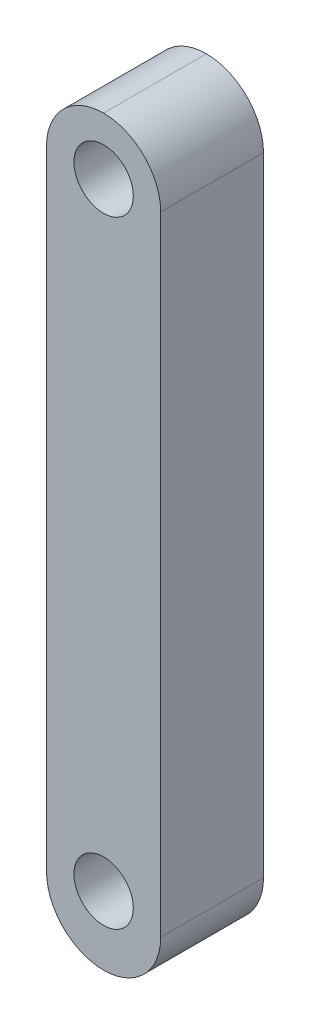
ISO-10303-21;
HEADER;
FILE_DESCRIPTION(('STEP AP214'),'2;1');
FILE_NAME('part.step','',(''),(''),'','','');
FILE_SCHEMA(('AUTOMOTIVE_DESIGN { 1 0 10303 214 1 1 1 1 }'));
ENDSEC;
DATA;
#1=APPLICATION_CONTEXT('core data for automotive mechanical design processes');
#2=APPLICATION_PROTOCOL_DEFINITION('international standard','automotive_design',2000,#1);
#3=PRODUCT_CONTEXT('',#1,'mechanical');
#4=PRODUCT('Part','Part','',(#3));
#5=PRODUCT_RELATED_PRODUCT_CATEGORY('part','',(#4));
#6=PRODUCT_DEFINITION_FORMATION('','',#4);
#7=PRODUCT_DEFINITION_CONTEXT('part definition',#1,'design');
#8=PRODUCT_DEFINITION('design','',#6,#7);
#9=PRODUCT_DEFINITION_SHAPE('','',#8);
#10=(LENGTH_UNIT() NAMED_UNIT(*) SI_UNIT(.MILLI.,.METRE.));
#11=(NAMED_UNIT(*) PLANE_ANGLE_UNIT() SI_UNIT($,.RADIAN.));
#12=(NAMED_UNIT(*) SI_UNIT($,.STERADIAN.) SOLID_ANGLE_UNIT());
#13=UNCERTAINTY_MEASURE_WITH_UNIT(LENGTH_MEASURE(1.E-05),#10,'distance_accuracy_value','');
#14=(GEOMETRIC_REPRESENTATION_CONTEXT(3) GLOBAL_UNCERTAINTY_ASSIGNED_CONTEXT((#13)) GLOBAL_UNIT_ASSIGNED_CONTEXT((#10,
#11,#12)) REPRESENTATION_CONTEXT('',''));
#15=CARTESIAN_POINT('',(0.,0.,0.));
#16=DIRECTION('',(0.,0.,1.));
#17=DIRECTION('',(1.,0.,0.));
#18=AXIS2_PLACEMENT_3D('',#15,#16,#17);
#19=CARTESIAN_POINT('',(2.5,16.25,4.5));
#20=DIRECTION('',(-1.,0.,0.));
#21=DIRECTION('',(0.,-1.,0.));
#22=AXIS2_PLACEMENT_3D('',#19,#20,#21);
#23=PLANE('',#22);
#24=DIRECTION('',(0.,1.,0.));
#25=VECTOR('',#24,1.);
#26=CARTESIAN_POINT('',(2.5,16.25,4.5));
#27=LINE('',#26,#25);
#28=CARTESIAN_POINT('',(2.5,-13.75,4.5));
#29=VERTEX_POINT('',#28);
#30=CARTESIAN_POINT('',(2.5,13.75,4.5));
#31=VERTEX_POINT('',#30);
#32=EDGE_CURVE('E161',#29,#31,#27,.T.);
#33=ORIENTED_EDGE('',*,*,#32,.F.);
#34=DIRECTION('',(0.,0.,-1.));
#35=VECTOR('',#34,1.);
#36=CARTESIAN_POINT('',(2.5,-13.75,4.5));
#37=LINE('',#36,#35);
#38=CARTESIAN_POINT('',(2.5,-13.75,0.));
#39=VERTEX_POINT('',#38);
#40=EDGE_CURVE('E11',#29,#39,#37,.T.);
#41=ORIENTED_EDGE('',*,*,#40,.T.);
#42=DIRECTION('',(0.,1.,0.));
#43=VECTOR('',#42,1.);
#44=CARTESIAN_POINT('',(2.5,16.25,0.));
#45=LINE('',#44,#43);
#46=CARTESIAN_POINT('',(2.5,13.75,0.));
#47=VERTEX_POINT('',#46);
#48=EDGE_CURVE('E101',#39,#47,#45,.T.);
#49=ORIENTED_EDGE('',*,*,#48,.T.);
#50=DIRECTION('',(0.,0.,-1.));
#51=VECTOR('',#50,1.);
#52=CARTESIAN_POINT('',(2.5,13.75,4.5));
#53=LINE('',#52,#51);
#54=EDGE_CURVE('E104',#47,#31,#53,.F.);
#55=ORIENTED_EDGE('',*,*,#54,.T.);
#56=EDGE_LOOP('',(#33,#41,#49,#55));
#57=FACE_BOUND('',#56,.T.);
#58=ADVANCED_FACE('F50',(#57),#23,.F.);
#59=CARTESIAN_POINT('',(-2.5,16.25,4.5));
#60=DIRECTION('',(1.,0.,0.));
#61=DIRECTION('',(0.,1.,0.));
#62=AXIS2_PLACEMENT_3D('',#59,#60,#61);
#63=PLANE('',#62);
#64=DIRECTION('',(0.,-1.,0.));
#65=VECTOR('',#64,1.);
#66=CARTESIAN_POINT('',(-2.5,16.25,0.));
#67=LINE('',#66,#65);
#68=CARTESIAN_POINT('',(-2.5,13.75,0.));
#69=VERTEX_POINT('',#68);
#70=CARTESIAN_POINT('',(-2.5,-13.75,0.));
#71=VERTEX_POINT('',#70);
#72=EDGE_CURVE('E109',#69,#71,#67,.T.);
#73=ORIENTED_EDGE('',*,*,#72,.T.);
#74=DIRECTION('',(0.,0.,-1.));
#75=VECTOR('',#74,1.);
#76=CARTESIAN_POINT('',(-2.5,-13.75,4.5));
#77=LINE('',#76,#75);
#78=CARTESIAN_POINT('',(-2.5,-13.75,4.5));
#79=VERTEX_POINT('',#78);
#80=EDGE_CURVE('E145',#71,#79,#77,.F.);
#81=ORIENTED_EDGE('',*,*,#80,.T.);
#82=DIRECTION('',(0.,-1.,0.));
#83=VECTOR('',#82,1.);
#84=CARTESIAN_POINT('',(-2.5,16.25,4.5));
#85=LINE('',#84,#83);
#86=CARTESIAN_POINT('',(-2.5,13.75,4.5));
#87=VERTEX_POINT('',#86);
#88=EDGE_CURVE('E154',#87,#79,#85,.T.);
#89=ORIENTED_EDGE('',*,*,#88,.F.);
#90=DIRECTION('',(0.,0.,-1.));
#91=VECTOR('',#90,1.);
#92=CARTESIAN_POINT('',(-2.5,13.75,4.5));
#93=LINE('',#92,#91);
#94=EDGE_CURVE('E132',#87,#69,#93,.T.);
#95=ORIENTED_EDGE('',*,*,#94,.T.);
#96=EDGE_LOOP('',(#73,#81,#89,#95));
#97=FACE_BOUND('',#96,.T.);
#98=ADVANCED_FACE('F153',(#97),#63,.F.);
#99=CARTESIAN_POINT('',(0.,0.,4.5));
#100=DIRECTION('',(0.,0.,1.));
#101=DIRECTION('',(1.,0.,0.));
#102=AXIS2_PLACEMENT_3D('',#99,#100,#101);
#103=PLANE('',#102);
#104=CARTESIAN_POINT('',(0.,-13.25,4.5));
#105=DIRECTION('',(0.,0.,1.));
#106=DIRECTION('',(1.,0.,0.));
#107=AXIS2_PLACEMENT_3D('',#104,#105,#106);
#108=CIRCLE('',#107,1.3);
#109=CARTESIAN_POINT('',(1.3,-13.25,4.5));
#110=VERTEX_POINT('',#109);
#111=EDGE_CURVE('E141',#110,#110,#108,.T.);
#112=ORIENTED_EDGE('',*,*,#111,.F.);
#113=EDGE_LOOP('',(#112));
#114=FACE_BOUND('',#113,.T.);
#115=CARTESIAN_POINT('',(0.,13.75,4.5));
#116=DIRECTION('',(0.,0.,1.));
#117=DIRECTION('',(1.,0.,0.));
#118=AXIS2_PLACEMENT_3D('',#115,#116,#117);
#119=CIRCLE('',#118,1.3);
#120=CARTESIAN_POINT('',(1.3,13.75,4.5));
#121=VERTEX_POINT('',#120);
#122=EDGE_CURVE('E140',#121,#121,#119,.T.);
#123=ORIENTED_EDGE('',*,*,#122,.F.);
#124=EDGE_LOOP('',(#123));
#125=FACE_BOUND('',#124,.T.);
#126=ORIENTED_EDGE('',*,*,#88,.T.);
#127=CARTESIAN_POINT('',(0.,-13.75,4.5));
#128=DIRECTION('',(0.,0.,1.));
#129=DIRECTION('',(1.,0.,0.));
#130=AXIS2_PLACEMENT_3D('',#127,#128,#129);
#131=CIRCLE('',#130,2.5);
#132=CARTESIAN_POINT('',(0.,-16.25,4.5));
#133=VERTEX_POINT('',#132);
#134=EDGE_CURVE('E59',#79,#133,#131,.T.);
#135=ORIENTED_EDGE('',*,*,#134,.T.);
#136=CARTESIAN_POINT('',(0.,-13.75,4.5));
#137=DIRECTION('',(0.,0.,1.));
#138=DIRECTION('',(1.,0.,0.));
#139=AXIS2_PLACEMENT_3D('',#136,#137,#138);
#140=CIRCLE('',#139,2.5);
#141=EDGE_CURVE('E69',#133,#29,#140,.T.);
#142=ORIENTED_EDGE('',*,*,#141,.T.);
#143=ORIENTED_EDGE('',*,*,#32,.T.);
#144=CARTESIAN_POINT('',(0.,13.75,4.5));
#145=DIRECTION('',(0.,0.,1.));
#146=DIRECTION('',(1.,0.,0.));
#147=AXIS2_PLACEMENT_3D('',#144,#145,#146);
#148=CIRCLE('',#147,2.5);
#149=CARTESIAN_POINT('',(0.,16.25,4.5));
#150=VERTEX_POINT('',#149);
#151=EDGE_CURVE('E125',#31,#150,#148,.T.);
#152=ORIENTED_EDGE('',*,*,#151,.T.);
#153=CARTESIAN_POINT('',(0.,13.75,4.5));
#154=DIRECTION('',(0.,0.,1.));
#155=DIRECTION('',(1.,0.,0.));
#156=AXIS2_PLACEMENT_3D('',#153,#154,#155);
#157=CIRCLE('',#156,2.5);
#158=EDGE_CURVE('E126',#150,#87,#157,.T.);
#159=ORIENTED_EDGE('',*,*,#158,.T.);
#160=EDGE_LOOP('',(#126,#135,#142,#143,#152,#159));
#161=FACE_BOUND('',#160,.T.);
#162=ADVANCED_FACE('F158',(#114,#125,#161),#103,.T.);
#163=CARTESIAN_POINT('',(0.,0.,0.));
#164=DIRECTION('',(0.,0.,1.));
#165=DIRECTION('',(1.,0.,0.));
#166=AXIS2_PLACEMENT_3D('',#163,#164,#165);
#167=PLANE('',#166);
#168=CARTESIAN_POINT('',(0.,-13.25,0.));
#169=DIRECTION('',(0.,0.,1.));
#170=DIRECTION('',(1.,0.,0.));
#171=AXIS2_PLACEMENT_3D('',#168,#169,#170);
#172=CIRCLE('',#171,1.3);
#173=CARTESIAN_POINT('',(1.3,-13.25,0.));
#174=VERTEX_POINT('',#173);
#175=EDGE_CURVE('E137',#174,#174,#172,.T.);
#176=ORIENTED_EDGE('',*,*,#175,.T.);
#177=EDGE_LOOP('',(#176));
#178=FACE_BOUND('',#177,.T.);
#179=CARTESIAN_POINT('',(0.,13.75,0.));
#180=DIRECTION('',(0.,0.,1.));
#181=DIRECTION('',(1.,0.,0.));
#182=AXIS2_PLACEMENT_3D('',#179,#180,#181);
#183=CIRCLE('',#182,1.3);
#184=CARTESIAN_POINT('',(1.3,13.75,0.));
#185=VERTEX_POINT('',#184);
#186=EDGE_CURVE('E136',#185,#185,#183,.T.);
#187=ORIENTED_EDGE('',*,*,#186,.T.);
#188=EDGE_LOOP('',(#187));
#189=FACE_BOUND('',#188,.T.);
#190=CARTESIAN_POINT('',(0.,-13.75,0.));
#191=DIRECTION('',(0.,0.,1.));
#192=DIRECTION('',(1.,0.,0.));
#193=AXIS2_PLACEMENT_3D('',#190,#191,#192);
#194=CIRCLE('',#193,2.5);
#195=CARTESIAN_POINT('',(0.,-16.25,0.));
#196=VERTEX_POINT('',#195);
#197=EDGE_CURVE('E134',#39,#196,#194,.F.);
#198=ORIENTED_EDGE('',*,*,#197,.T.);
#199=CARTESIAN_POINT('',(0.,-13.75,0.));
#200=DIRECTION('',(0.,0.,1.));
#201=DIRECTION('',(1.,0.,0.));
#202=AXIS2_PLACEMENT_3D('',#199,#200,#201);
#203=CIRCLE('',#202,2.5);
#204=EDGE_CURVE('E143',#196,#71,#203,.F.);
#205=ORIENTED_EDGE('',*,*,#204,.T.);
#206=ORIENTED_EDGE('',*,*,#72,.F.);
#207=CARTESIAN_POINT('',(0.,13.75,0.));
#208=DIRECTION('',(0.,0.,1.));
#209=DIRECTION('',(1.,0.,0.));
#210=AXIS2_PLACEMENT_3D('',#207,#208,#209);
#211=CIRCLE('',#210,2.5);
#212=CARTESIAN_POINT('',(0.,16.25,0.));
#213=VERTEX_POINT('',#212);
#214=EDGE_CURVE('E117',#69,#213,#211,.F.);
#215=ORIENTED_EDGE('',*,*,#214,.T.);
#216=CARTESIAN_POINT('',(0.,13.75,0.));
#217=DIRECTION('',(0.,0.,1.));
#218=DIRECTION('',(1.,0.,0.));
#219=AXIS2_PLACEMENT_3D('',#216,#217,#218);
#220=CIRCLE('',#219,2.5);
#221=EDGE_CURVE('E113',#213,#47,#220,.F.);
#222=ORIENTED_EDGE('',*,*,#221,.T.);
#223=ORIENTED_EDGE('',*,*,#48,.F.);
#224=EDGE_LOOP('',(#198,#205,#206,#215,#222,#223));
#225=FACE_BOUND('',#224,.T.);
#226=ADVANCED_FACE('F114',(#178,#189,#225),#167,.F.);
#227=CARTESIAN_POINT('',(0.,13.75,4.5));
#228=DIRECTION('',(0.,0.,-1.));
#229=DIRECTION('',(-1.,0.,0.));
#230=AXIS2_PLACEMENT_3D('',#227,#228,#229);
#231=CYLINDRICAL_SURFACE('',#230,2.5);
#232=ORIENTED_EDGE('',*,*,#94,.F.);
#233=ORIENTED_EDGE('',*,*,#158,.F.);
#234=DIRECTION('',(0.,0.,-1.));
#235=VECTOR('',#234,1.);
#236=CARTESIAN_POINT('',(0.,16.25,4.5));
#237=LINE('',#236,#235);
#238=EDGE_CURVE('E110',#213,#150,#237,.F.);
#239=ORIENTED_EDGE('',*,*,#238,.F.);
#240=ORIENTED_EDGE('',*,*,#214,.F.);
#241=EDGE_LOOP('',(#232,#233,#239,#240));
#242=FACE_BOUND('',#241,.T.);
#243=ADVANCED_FACE('F178',(#242),#231,.T.);
#244=CARTESIAN_POINT('',(0.,13.75,4.5));
#245=DIRECTION('',(0.,0.,-1.));
#246=DIRECTION('',(-1.,0.,0.));
#247=AXIS2_PLACEMENT_3D('',#244,#245,#246);
#248=CYLINDRICAL_SURFACE('',#247,2.5);
#249=ORIENTED_EDGE('',*,*,#151,.F.);
#250=ORIENTED_EDGE('',*,*,#54,.F.);
#251=ORIENTED_EDGE('',*,*,#221,.F.);
#252=ORIENTED_EDGE('',*,*,#238,.T.);
#253=EDGE_LOOP('',(#249,#250,#251,#252));
#254=FACE_BOUND('',#253,.T.);
#255=ADVANCED_FACE('F124',(#254),#248,.T.);
#256=CARTESIAN_POINT('',(0.,13.75,0.));
#257=DIRECTION('',(0.,0.,1.));
#258=DIRECTION('',(1.,0.,0.));
#259=AXIS2_PLACEMENT_3D('',#256,#257,#258);
#260=CYLINDRICAL_SURFACE('',#259,1.3);
#261=ORIENTED_EDGE('',*,*,#186,.F.);
#262=EDGE_LOOP('',(#261));
#263=FACE_BOUND('',#262,.T.);
#264=ORIENTED_EDGE('',*,*,#122,.T.);
#265=EDGE_LOOP('',(#264));
#266=FACE_BOUND('',#265,.T.);
#267=ADVANCED_FACE('F185',(#263,#266),#260,.F.);
#268=CARTESIAN_POINT('',(0.,-13.25,-15.5));
#269=DIRECTION('',(0.,0.,1.));
#270=DIRECTION('',(1.,0.,0.));
#271=AXIS2_PLACEMENT_3D('',#268,#269,#270);
#272=CYLINDRICAL_SURFACE('',#271,1.3);
#273=ORIENTED_EDGE('',*,*,#111,.T.);
#274=EDGE_LOOP('',(#273));
#275=FACE_BOUND('',#274,.T.);
#276=ORIENTED_EDGE('',*,*,#175,.F.);
#277=EDGE_LOOP('',(#276));
#278=FACE_BOUND('',#277,.T.);
#279=ADVANCED_FACE('F201',(#275,#278),#272,.F.);
#280=CARTESIAN_POINT('',(0.,-13.75,4.5));
#281=DIRECTION('',(0.,0.,-1.));
#282=DIRECTION('',(-1.,0.,0.));
#283=AXIS2_PLACEMENT_3D('',#280,#281,#282);
#284=CYLINDRICAL_SURFACE('',#283,2.5);
#285=ORIENTED_EDGE('',*,*,#40,.F.);
#286=ORIENTED_EDGE('',*,*,#141,.F.);
#287=DIRECTION('',(0.,0.,-1.));
#288=VECTOR('',#287,1.);
#289=CARTESIAN_POINT('',(0.,-16.25,4.5));
#290=LINE('',#289,#288);
#291=EDGE_CURVE('E54',#196,#133,#290,.F.);
#292=ORIENTED_EDGE('',*,*,#291,.F.);
#293=ORIENTED_EDGE('',*,*,#197,.F.);
#294=EDGE_LOOP('',(#285,#286,#292,#293));
#295=FACE_BOUND('',#294,.T.);
#296=ADVANCED_FACE('F52',(#295),#284,.T.);
#297=CARTESIAN_POINT('',(0.,-13.75,4.5));
#298=DIRECTION('',(0.,0.,-1.));
#299=DIRECTION('',(-1.,0.,0.));
#300=AXIS2_PLACEMENT_3D('',#297,#298,#299);
#301=CYLINDRICAL_SURFACE('',#300,2.5);
#302=ORIENTED_EDGE('',*,*,#134,.F.);
#303=ORIENTED_EDGE('',*,*,#80,.F.);
#304=ORIENTED_EDGE('',*,*,#204,.F.);
#305=ORIENTED_EDGE('',*,*,#291,.T.);
#306=EDGE_LOOP('',(#302,#303,#304,#305));
#307=FACE_BOUND('',#306,.T.);
#308=ADVANCED_FACE('F175',(#307),#301,.T.);
#309=CLOSED_SHELL('',(#58,#98,#162,#226,#243,#255,#267,#279,#296,#308));
#310=MANIFOLD_SOLID_BREP('B2',#309);
#311=ADVANCED_BREP_SHAPE_REPRESENTATION('',(#18,#310),#14);
#312=SHAPE_DEFINITION_REPRESENTATION(#9,#311);
ENDSEC;
END-ISO-10303-21;
